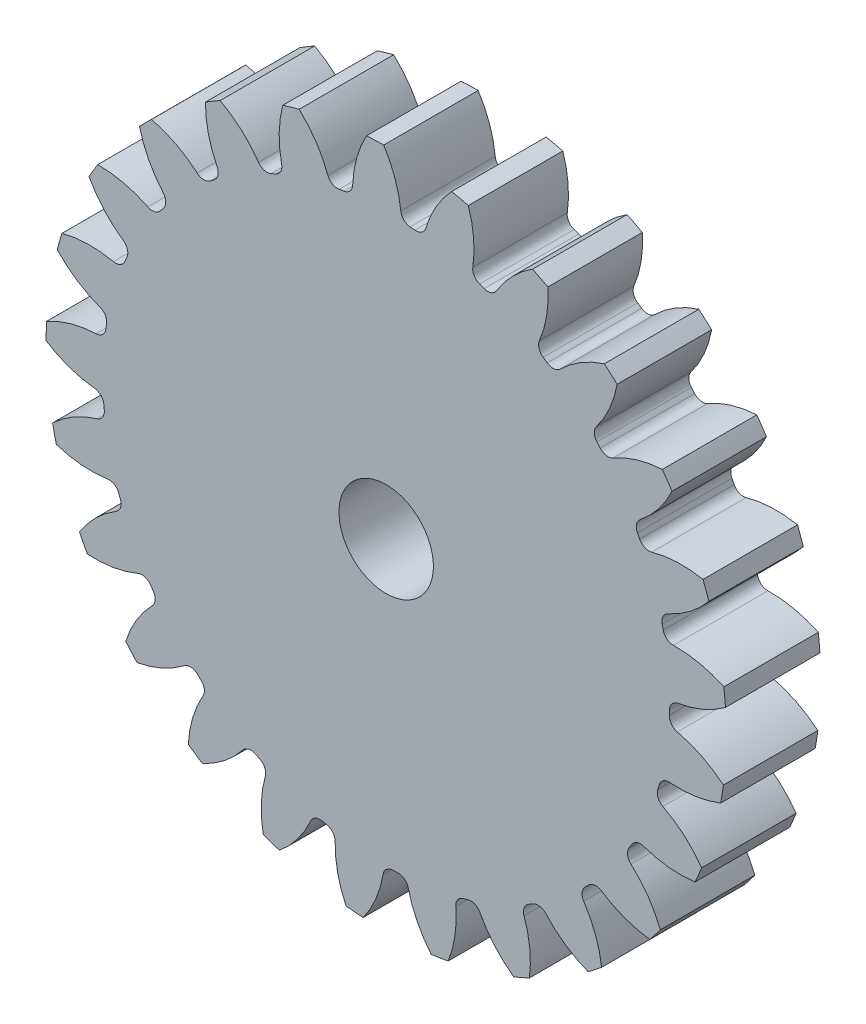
from build123d import *

# Parameters (mm, degrees)
SKETCH3_R         = 457.2
GEARBODY_DEPTH    = 127
TOOTHCUT_DEPTH    = 659.932985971
CIRPATTERN1_COUNT = 25
BOREDIA_R         = 63.5
BORE_DEPTH        = 12700


with BuildPart() as part:
    # Sketch3 → gearBody (new body)
    with BuildSketch(Plane.XY):
        Circle(SKETCH3_R)
    extrude(amount=GEARBODY_DEPTH)

    # Sketch2 → toothCut (cut, through all)
    with BuildSketch(Plane.XY):
        with BuildLine():
            ThreePointArc((380.710676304, -14.845233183), (380.824690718, -11.556597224), (380.910297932, -8.267099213))
            ThreePointArc((380.910297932, -8.267099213), (384.260751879, 0.445235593), (392.394436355, 5.024918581))
            ThreePointArc((392.394436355, 5.024918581), (426.465490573, 15.066922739), (457.2, 32.873340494))
            ThreePointArc((457.2, 32.873340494), (458.169382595, -13.903717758), (454.365380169, -60.535921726))
            ThreePointArc((454.365380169, -60.535921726), (424.767146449, -40.898632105), (391.367699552, -28.809151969))
            ThreePointArc((391.367699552, -28.809151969), (383.526678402, -23.744696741), (380.710676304, -14.845233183))
        make_face()
    toothcut = extrude(amount=TOOTHCUT_DEPTH, mode=Mode.SUBTRACT)

    # CirPattern1: toothCut ×25 about axis
    cirpattern1_axis = Axis((0, 0, 0), (0, 0, 1))
    for i in range(1, CIRPATTERN1_COUNT):
        add(toothcut.rotate(cirpattern1_axis, i * 360 / CIRPATTERN1_COUNT), mode=Mode.SUBTRACT)

    # boreDia → bore (cut, symmetric)
    with BuildSketch(Plane.XY):
        Circle(BOREDIA_R)
    extrude(amount=BORE_DEPTH, both=True, mode=Mode.SUBTRACT)


solid = part.part
